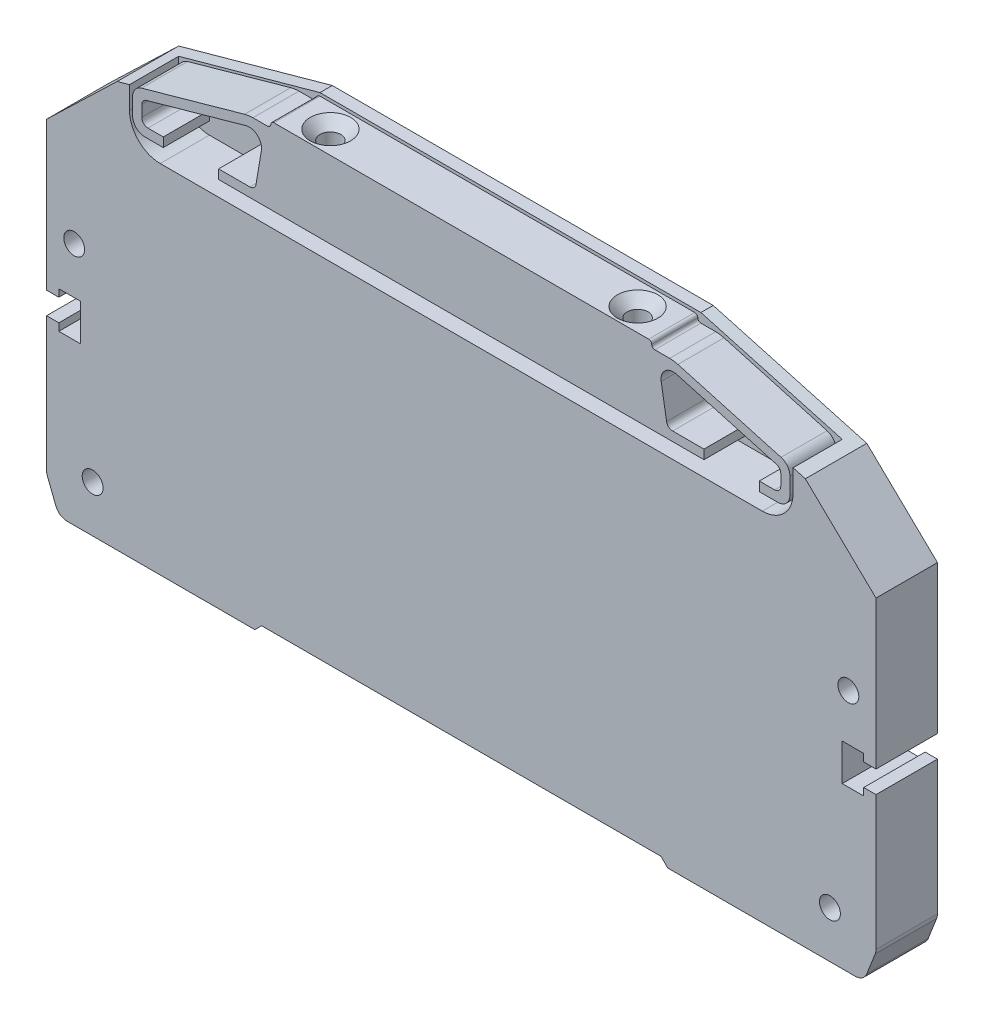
from build123d import *

# Parameters (mm, degrees)
EXTRUDE_1_DEPTH            = 10
HOLE_WIZARD_1_AT_2_COUNT   = 2
HOLE_WIZARD_1_AT_2_PITCH   = 32.239882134
HOLE_WIZARD_1_AT_3_COUNT   = 2
HOLE_WIZARD_1_AT_3_PITCH   = 127.11966803
HOLE_WIZARD_1_AT_4_COUNT   = 2
HOLE_WIZARD_1_AT_4_PITCH   = 126
CUT_EXTRUDE_1_DEPTH        = 8
EXTRUDE_2_DEPTH            = 7.5
HOLE_WIZARD_1_2_AT_2_COUNT = 2
HOLE_WIZARD_1_2_AT_2_PITCH = 50


with BuildPart() as part:
    # Sketch 1 → Extrude 1 (new body)
    with BuildSketch(Plane.XY):
        with BuildLine():
            Line((-67.5, 53.9), (-55.999723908, 64.966962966))
            Line((-55.999723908, 64.966962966), (-31, 71.9))
            Line((-31, 71.9), (31, 71.9))
            Line((31, 71.9), (55.999723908, 64.966962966))
            Line((55.999723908, 64.966962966), (67.5, 53.9))
            Line((67.5, 53.9), (67.5, 29.8))
            Line((67.5, 29.8), (65.5, 29.8))
            Line((65.5, 29.8), (65.5, 31))
            Line((65.5, 31), (62, 31))
            Line((62, 31), (62, 25))
            Line((62, 25), (65.5, 25))
            Line((65.5, 25), (65.5, 26.2))
            Line((65.5, 26.2), (67.5, 26.2))
            Line((67.5, 26.2), (67.499998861, 4.379834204))
            ThreePointArc((67.499998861, 4.379834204), (67.464593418, 4.007305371), (67.360411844, 3.647892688))
            Line((67.360411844, 3.647892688), (65.994844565, 0.168695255))
            ThreePointArc((65.994844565, 0.168695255), (65.259705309, -0.752665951), (64.133341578, -1.1))
            Line((64.133341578, -1.1), (33.6, -1.1))
            Line((33.6, -1.1), (32.5, 0))
            Line((32.5, 0), (-32.5, 0))
            Line((-32.5, 0), (-33.6, -1.1))
            Line((-33.6, -1.1), (-64.133341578, -1.1))
            ThreePointArc((-64.133341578, -1.1), (-65.259705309, -0.752665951), (-65.994844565, 0.168695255))
            Line((-65.994844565, 0.168695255), (-67.360776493, 3.648815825))
            ThreePointArc((-67.360776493, 3.648815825), (-67.46458704, 4.007268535), (-67.499998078, 4.378766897))
            Line((-67.499998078, 4.378766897), (-67.5, 26.2))
            Line((-67.5, 26.2), (-65.5, 26.2))
            Line((-65.5, 26.2), (-65.5, 25))
            Line((-65.5, 25), (-62, 25))
            Line((-62, 25), (-62, 31))
            Line((-62, 31), (-65.5, 31))
            Line((-65.5, 31), (-65.5, 29.8))
            Line((-65.5, 29.8), (-67.5, 29.8))
            Line((-67.5, 29.8), (-67.5, 53.9))
        make_face()
    extrude(amount=EXTRUDE_1_DEPTH)

    # Sketch 3 → Hole Wizard 1 (revolve, cut)
    with BuildSketch(Plane(origin=(63, 38.6, 0), x_dir=(0, 1, 0), z_dir=(1, 0, 0))):
        Polygon((0, 0), (0, 10), (1.7, 10), (1.7, 3.4), (3, 3.4), (3, 0.3), (3.3, 0), align=None)
    hole_wizard_1 = revolve(axis=Axis((63, 38.6, -6.35), (0, 0, 1)), mode=Mode.SUBTRACT)

    # Hole Wizard 1 at 2: Hole Wizard 1 ×2
    with Locations(*[Vector(-0.09305244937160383, -0.9956612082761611, 0) * (i * HOLE_WIZARD_1_AT_2_PITCH) for i in range(1, HOLE_WIZARD_1_AT_2_COUNT)]):
        add(hole_wizard_1, mode=Mode.SUBTRACT)

    # Hole Wizard 1 at 3: Hole Wizard 1 ×2
    with Locations(*[Vector(-0.9675922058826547, -0.2525179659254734, 0) * (i * HOLE_WIZARD_1_AT_3_PITCH) for i in range(1, HOLE_WIZARD_1_AT_3_COUNT)]):
        add(hole_wizard_1, mode=Mode.SUBTRACT)

    # Hole Wizard 1 at 4: Hole Wizard 1 ×2
    with Locations(*[(-i * HOLE_WIZARD_1_AT_4_PITCH, 0, 0) for i in range(1, HOLE_WIZARD_1_AT_4_COUNT)]):
        add(hole_wizard_1, mode=Mode.SUBTRACT)

    # Sketch 4 → Cut-Extrude 1 (cut)
    with BuildSketch(Plane(origin=(0, 0, 10), x_dir=(-1, 0, 0), z_dir=(0, 0, -1))):
        with BuildLine():
            Line((-49, 56.9), (49, 56.9))
            ThreePointArc((49, 56.9), (52.535533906, 58.364466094), (54, 61.9))
            Line((54, 61.9), (54, 97.083652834))
            Line((54, 97.083652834), (-54, 97.083652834))
            Line((-54, 97.083652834), (-54, 61.9))
            ThreePointArc((-54, 61.9), (-52.535533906, 58.364466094), (-49, 56.9))
        make_face()
    extrude(amount=CUT_EXTRUDE_1_DEPTH, mode=Mode.SUBTRACT)


with BuildPart() as body_2:
    # Sketch 5 → Extrude 2 (new body)
    with BuildSketch(Plane.XY.offset(10)):
        with BuildLine():
            Line((-39.5, 59.4), (39.5, 59.4))
            Line((39.5, 59.4), (39.5, 60.9))
            Line((39.5, 60.9), (34.4, 60.9))
            ThreePointArc((34.4, 60.9), (33.754110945, 61.136568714), (33.413816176, 61.734345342))
            Line((33.413816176, 61.734345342), (32.536146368, 66.959334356))
            ThreePointArc((32.536146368, 66.959334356), (33.171932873, 68.778444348), (35.048529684, 69.216359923))
            Line((35.048529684, 69.216359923), (51.270007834, 64.667479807))
            ThreePointArc((51.270007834, 64.667479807), (51.79687133, 64.308770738), (52, 63.704621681))
            Line((52, 63.704621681), (52, 61.9))
            ThreePointArc((52, 61.9), (51.707106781, 61.192893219), (51, 60.9))
            Line((51, 60.9), (48.5, 60.9))
            Line((48.5, 60.9), (48.5, 59.4))
            Line((48.5, 59.4), (51.5, 59.4))
            ThreePointArc((51.5, 59.4), (52.914213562, 59.985786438), (53.5, 61.4))
            Line((53.5, 61.4), (53.5, 64.083697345))
            ThreePointArc((53.5, 64.083697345), (53.093742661, 65.291995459), (52.040015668, 66.009413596))
            Line((52.040015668, 66.009413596), (35.262246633, 70.714290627))
            ThreePointArc((35.262246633, 70.714290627), (34.593583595, 70.853355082), (33.912207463, 70.9))
            Line((33.912207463, 70.9), (31.5, 70.9))
            ThreePointArc((31.5, 70.9), (31.146446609, 71.046446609), (31, 71.4))
            ThreePointArc((31, 71.4), (30.853553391, 71.753553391), (30.5, 71.9))
            Line((30.5, 71.9), (-30.5, 71.9))
            ThreePointArc((-30.5, 71.9), (-30.853553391, 71.753553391), (-31, 71.4))
            ThreePointArc((-31, 71.4), (-31.146446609, 71.046446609), (-31.5, 70.9))
            Line((-31.5, 70.9), (-33.912207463, 70.9))
            ThreePointArc((-33.912207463, 70.9), (-34.593583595, 70.853355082), (-35.262246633, 70.714290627))
            Line((-35.262246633, 70.714290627), (-52.040015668, 66.009413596))
            ThreePointArc((-52.040015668, 66.009413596), (-53.093742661, 65.291995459), (-53.5, 64.083697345))
            Line((-53.5, 64.083697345), (-53.5, 61.4))
            ThreePointArc((-53.5, 61.4), (-52.914213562, 59.985786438), (-51.5, 59.4))
            Line((-51.5, 59.4), (-48.5, 59.4))
            Line((-48.5, 59.4), (-48.5, 60.9))
            Line((-48.5, 60.9), (-51, 60.9))
            ThreePointArc((-51, 60.9), (-51.707106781, 61.192893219), (-52, 61.9))
            Line((-52, 61.9), (-52, 63.704621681))
            ThreePointArc((-52, 63.704621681), (-51.79687133, 64.308770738), (-51.270007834, 64.667479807))
            Line((-51.270007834, 64.667479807), (-35.048529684, 69.216359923))
            ThreePointArc((-35.048529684, 69.216359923), (-33.171932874, 68.778444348), (-32.536146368, 66.959334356))
            Line((-32.536146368, 66.959334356), (-33.413816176, 61.734345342))
            ThreePointArc((-33.413816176, 61.734345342), (-33.754110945, 61.136568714), (-34.4, 60.9))
            Line((-34.4, 60.9), (-39.5, 60.9))
            Line((-39.5, 60.9), (-39.5, 59.4))
        make_face()
    extrude(amount=-EXTRUDE_2_DEPTH)

    # Sketch 7 → Hole Wizard 1 2 (revolve, cut)
    with BuildSketch(Plane(origin=(-25, 71.9, 6.3), x_dir=(0, 0, 1), z_dir=(1, 0, 0))):
        Polygon((0, 0), (0, 71.9), (1.7, 71.9), (1.7, 1.6), (3.3, 0), align=None)
    hole_wizard_1_2 = revolve(axis=Axis((-25, 78.25, 6.3), (0, -1, 0)), mode=Mode.SUBTRACT)

    # Hole Wizard 1 2 at 2: Hole Wizard 1 2 ×2
    with Locations(*[(i * HOLE_WIZARD_1_2_AT_2_PITCH, 0, 0) for i in range(1, HOLE_WIZARD_1_2_AT_2_COUNT)]):
        add(hole_wizard_1_2, mode=Mode.SUBTRACT)


solid = Compound([part.part, body_2.part])
